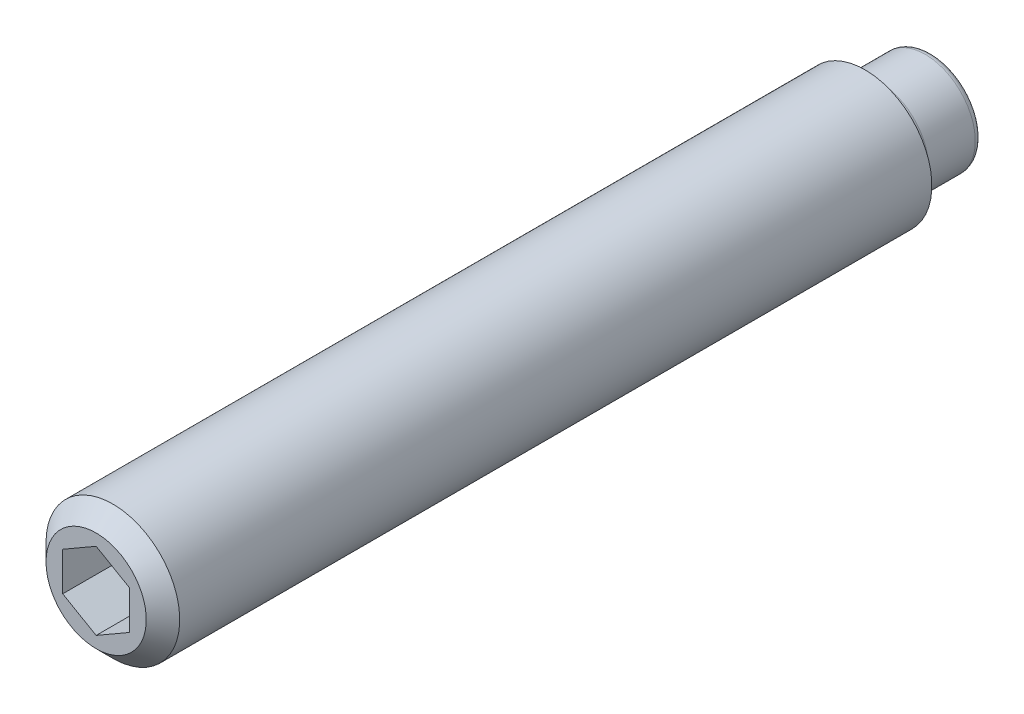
ISO-10303-21;
HEADER;
FILE_DESCRIPTION(('STEP AP214'),'2;1');
FILE_NAME('part.step','',(''),(''),'','','');
FILE_SCHEMA(('AUTOMOTIVE_DESIGN { 1 0 10303 214 1 1 1 1 }'));
ENDSEC;
DATA;
#1=APPLICATION_CONTEXT('core data for automotive mechanical design processes');
#2=APPLICATION_PROTOCOL_DEFINITION('international standard','automotive_design',2000,#1);
#3=PRODUCT_CONTEXT('',#1,'mechanical');
#4=PRODUCT('Part','Part','',(#3));
#5=PRODUCT_RELATED_PRODUCT_CATEGORY('part','',(#4));
#6=PRODUCT_DEFINITION_FORMATION('','',#4);
#7=PRODUCT_DEFINITION_CONTEXT('part definition',#1,'design');
#8=PRODUCT_DEFINITION('design','',#6,#7);
#9=PRODUCT_DEFINITION_SHAPE('','',#8);
#10=(LENGTH_UNIT() NAMED_UNIT(*) SI_UNIT(.MILLI.,.METRE.));
#11=(NAMED_UNIT(*) PLANE_ANGLE_UNIT() SI_UNIT($,.RADIAN.));
#12=(NAMED_UNIT(*) SI_UNIT($,.STERADIAN.) SOLID_ANGLE_UNIT());
#13=UNCERTAINTY_MEASURE_WITH_UNIT(LENGTH_MEASURE(1.E-05),#10,'distance_accuracy_value','');
#14=(GEOMETRIC_REPRESENTATION_CONTEXT(3) GLOBAL_UNCERTAINTY_ASSIGNED_CONTEXT((#13)) GLOBAL_UNIT_ASSIGNED_CONTEXT((#10,
#11,#12)) REPRESENTATION_CONTEXT('',''));
#15=CARTESIAN_POINT('',(0.,0.,0.));
#16=DIRECTION('',(0.,0.,1.));
#17=DIRECTION('',(1.,0.,0.));
#18=AXIS2_PLACEMENT_3D('',#15,#16,#17);
#19=CARTESIAN_POINT('',(0.,0.,100.000000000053));
#20=DIRECTION('',(0.,0.,-1.));
#21=DIRECTION('',(-1.,0.,0.));
#22=AXIS2_PLACEMENT_3D('',#19,#20,#21);
#23=PLANE('',#22);
#24=DIRECTION('',(-0.866025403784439,-0.5,0.));
#25=VECTOR('',#24,1.);
#26=CARTESIAN_POINT('',(0.,4.61880215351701,100.000000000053));
#27=LINE('',#26,#25);
#28=CARTESIAN_POINT('',(0.,4.61880215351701,100.000000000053));
#29=VERTEX_POINT('',#28);
#30=CARTESIAN_POINT('',(-4.,2.30940107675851,100.000000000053));
#31=VERTEX_POINT('',#30);
#32=EDGE_CURVE('E102',#29,#31,#27,.T.);
#33=ORIENTED_EDGE('',*,*,#32,.F.);
#34=DIRECTION('',(-0.866025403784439,0.5,0.));
#35=VECTOR('',#34,1.);
#36=CARTESIAN_POINT('',(4.,2.30940107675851,100.000000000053));
#37=LINE('',#36,#35);
#38=CARTESIAN_POINT('',(4.,2.30940107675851,100.000000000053));
#39=VERTEX_POINT('',#38);
#40=EDGE_CURVE('E28',#39,#29,#37,.T.);
#41=ORIENTED_EDGE('',*,*,#40,.F.);
#42=DIRECTION('',(0.,1.,0.));
#43=VECTOR('',#42,1.);
#44=CARTESIAN_POINT('',(4.,-2.30940107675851,100.000000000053));
#45=LINE('',#44,#43);
#46=CARTESIAN_POINT('',(4.,-2.30940107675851,100.000000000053));
#47=VERTEX_POINT('',#46);
#48=EDGE_CURVE('E111',#47,#39,#45,.T.);
#49=ORIENTED_EDGE('',*,*,#48,.F.);
#50=DIRECTION('',(0.866025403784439,0.5,0.));
#51=VECTOR('',#50,1.);
#52=CARTESIAN_POINT('',(0.,-4.61880215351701,100.000000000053));
#53=LINE('',#52,#51);
#54=CARTESIAN_POINT('',(0.,-4.61880215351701,100.000000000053));
#55=VERTEX_POINT('',#54);
#56=EDGE_CURVE('E109',#55,#47,#53,.T.);
#57=ORIENTED_EDGE('',*,*,#56,.F.);
#58=DIRECTION('',(0.866025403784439,-0.5,0.));
#59=VECTOR('',#58,1.);
#60=CARTESIAN_POINT('',(-4.,-2.30940107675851,100.000000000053));
#61=LINE('',#60,#59);
#62=CARTESIAN_POINT('',(-4.,-2.30940107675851,100.000000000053));
#63=VERTEX_POINT('',#62);
#64=EDGE_CURVE('E76',#63,#55,#61,.T.);
#65=ORIENTED_EDGE('',*,*,#64,.F.);
#66=DIRECTION('',(0.,-1.,0.));
#67=VECTOR('',#66,1.);
#68=CARTESIAN_POINT('',(-4.,2.30940107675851,100.000000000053));
#69=LINE('',#68,#67);
#70=EDGE_CURVE('E105',#31,#63,#69,.T.);
#71=ORIENTED_EDGE('',*,*,#70,.F.);
#72=EDGE_LOOP('',(#33,#41,#49,#57,#65,#71));
#73=FACE_BOUND('',#72,.T.);
#74=CARTESIAN_POINT('',(0.,0.,100.000000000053));
#75=DIRECTION('',(0.,0.,-1.));
#76=DIRECTION('',(-1.,0.,0.));
#77=AXIS2_PLACEMENT_3D('',#74,#75,#76);
#78=CIRCLE('',#77,5.99999999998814);
#79=CARTESIAN_POINT('',(-5.99999999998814,0.,100.000000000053));
#80=VERTEX_POINT('',#79);
#81=EDGE_CURVE('E9',#80,#80,#78,.T.);
#82=ORIENTED_EDGE('',*,*,#81,.F.);
#83=EDGE_LOOP('',(#82));
#84=FACE_BOUND('',#83,.T.);
#85=ADVANCED_FACE('F14',(#73,#84),#23,.F.);
#86=CARTESIAN_POINT('',(0.,0.,100.000000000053));
#87=DIRECTION('',(0.,0.,-1.));
#88=DIRECTION('',(-1.,0.,0.));
#89=AXIS2_PLACEMENT_3D('',#86,#87,#88);
#90=CONICAL_SURFACE('',#89,5.99999999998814,0.785398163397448);
#91=CARTESIAN_POINT('',(0.,0.,98.));
#92=DIRECTION('',(0.,0.,-1.));
#93=DIRECTION('',(-1.,0.,0.));
#94=AXIS2_PLACEMENT_3D('',#91,#92,#93);
#95=CIRCLE('',#94,8.00000000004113);
#96=CARTESIAN_POINT('',(-8.00000000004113,0.,98.));
#97=VERTEX_POINT('',#96);
#98=EDGE_CURVE('E21',#97,#97,#95,.T.);
#99=ORIENTED_EDGE('',*,*,#98,.F.);
#100=EDGE_LOOP('',(#99));
#101=FACE_BOUND('',#100,.T.);
#102=ORIENTED_EDGE('',*,*,#81,.T.);
#103=EDGE_LOOP('',(#102));
#104=FACE_BOUND('',#103,.T.);
#105=ADVANCED_FACE('F139',(#101,#104),#90,.T.);
#106=CARTESIAN_POINT('',(0.,0.,0.));
#107=DIRECTION('',(0.,0.,-1.));
#108=DIRECTION('',(-1.,0.,0.));
#109=AXIS2_PLACEMENT_3D('',#106,#107,#108);
#110=CYLINDRICAL_SURFACE('',#109,8.00000000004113);
#111=CARTESIAN_POINT('',(0.,0.,7.99999999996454));
#112=DIRECTION('',(0.,0.,-1.));
#113=DIRECTION('',(-1.,0.,0.));
#114=AXIS2_PLACEMENT_3D('',#111,#112,#113);
#115=CIRCLE('',#114,8.00000000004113);
#116=CARTESIAN_POINT('',(-8.00000000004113,0.,7.99999999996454));
#117=VERTEX_POINT('',#116);
#118=EDGE_CURVE('E132',#117,#117,#115,.T.);
#119=ORIENTED_EDGE('',*,*,#118,.F.);
#120=EDGE_LOOP('',(#119));
#121=FACE_BOUND('',#120,.T.);
#122=ORIENTED_EDGE('',*,*,#98,.T.);
#123=EDGE_LOOP('',(#122));
#124=FACE_BOUND('',#123,.T.);
#125=ADVANCED_FACE('F137',(#121,#124),#110,.T.);
#126=CARTESIAN_POINT('',(0.,0.,7.99999999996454));
#127=DIRECTION('',(0.,0.,1.));
#128=DIRECTION('',(1.,0.,0.));
#129=AXIS2_PLACEMENT_3D('',#126,#127,#128);
#130=CONICAL_SURFACE('',#129,8.00000000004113,1.0471975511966);
#131=CARTESIAN_POINT('',(0.,0.,7.07623956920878));
#132=DIRECTION('',(0.,0.,-1.));
#133=DIRECTION('',(-1.,0.,0.));
#134=AXIS2_PLACEMENT_3D('',#131,#132,#133);
#135=CIRCLE('',#134,6.39999999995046);
#136=CARTESIAN_POINT('',(-6.39999999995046,0.,7.07623956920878));
#137=VERTEX_POINT('',#136);
#138=EDGE_CURVE('E129',#137,#137,#135,.T.);
#139=ORIENTED_EDGE('',*,*,#138,.F.);
#140=EDGE_LOOP('',(#139));
#141=FACE_BOUND('',#140,.T.);
#142=ORIENTED_EDGE('',*,*,#118,.T.);
#143=EDGE_LOOP('',(#142));
#144=FACE_BOUND('',#143,.T.);
#145=ADVANCED_FACE('F183',(#141,#144),#130,.T.);
#146=CARTESIAN_POINT('',(0.,0.,6.38341924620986));
#147=DIRECTION('',(0.,0.,-1.));
#148=DIRECTION('',(-1.,0.,0.));
#149=AXIS2_PLACEMENT_3D('',#146,#147,#148);
#150=TOROIDAL_SURFACE('',#149,6.8,0.8);
#151=CARTESIAN_POINT('',(0.,0.,6.38341924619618));
#152=DIRECTION('',(0.,0.,-1.));
#153=DIRECTION('',(-1.,0.,0.));
#154=AXIS2_PLACEMENT_3D('',#151,#152,#153);
#155=CIRCLE('',#154,6.);
#156=CARTESIAN_POINT('',(-6.,0.,6.38341924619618));
#157=VERTEX_POINT('',#156);
#158=EDGE_CURVE('E126',#157,#157,#155,.T.);
#159=ORIENTED_EDGE('',*,*,#158,.F.);
#160=EDGE_LOOP('',(#159));
#161=FACE_BOUND('',#160,.T.);
#162=ORIENTED_EDGE('',*,*,#138,.T.);
#163=EDGE_LOOP('',(#162));
#164=FACE_BOUND('',#163,.T.);
#165=ADVANCED_FACE('F179',(#161,#164),#150,.F.);
#166=CARTESIAN_POINT('',(0.,0.,0.));
#167=DIRECTION('',(0.,0.,-1.));
#168=DIRECTION('',(-1.,0.,0.));
#169=AXIS2_PLACEMENT_3D('',#166,#167,#168);
#170=CYLINDRICAL_SURFACE('',#169,6.);
#171=CARTESIAN_POINT('',(0.,0.,0.800000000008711));
#172=DIRECTION('',(0.,0.,-1.));
#173=DIRECTION('',(-1.,0.,0.));
#174=AXIS2_PLACEMENT_3D('',#171,#172,#173);
#175=CIRCLE('',#174,6.);
#176=CARTESIAN_POINT('',(-6.,0.,0.800000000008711));
#177=VERTEX_POINT('',#176);
#178=EDGE_CURVE('E123',#177,#177,#175,.T.);
#179=ORIENTED_EDGE('',*,*,#178,.F.);
#180=EDGE_LOOP('',(#179));
#181=FACE_BOUND('',#180,.T.);
#182=ORIENTED_EDGE('',*,*,#158,.T.);
#183=EDGE_LOOP('',(#182));
#184=FACE_BOUND('',#183,.T.);
#185=ADVANCED_FACE('F175',(#181,#184),#170,.T.);
#186=CARTESIAN_POINT('',(0.,0.,0.8));
#187=DIRECTION('',(0.,0.,-1.));
#188=DIRECTION('',(-1.,0.,0.));
#189=AXIS2_PLACEMENT_3D('',#186,#187,#188);
#190=TOROIDAL_SURFACE('',#189,5.2,0.8);
#191=CARTESIAN_POINT('',(0.,0.,0.));
#192=DIRECTION('',(0.,0.,-1.));
#193=DIRECTION('',(-1.,0.,0.));
#194=AXIS2_PLACEMENT_3D('',#191,#192,#193);
#195=CIRCLE('',#194,5.19999999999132);
#196=CARTESIAN_POINT('',(-5.19999999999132,0.,0.));
#197=VERTEX_POINT('',#196);
#198=EDGE_CURVE('E115',#197,#197,#195,.T.);
#199=ORIENTED_EDGE('',*,*,#198,.F.);
#200=EDGE_LOOP('',(#199));
#201=FACE_BOUND('',#200,.T.);
#202=ORIENTED_EDGE('',*,*,#178,.T.);
#203=EDGE_LOOP('',(#202));
#204=FACE_BOUND('',#203,.T.);
#205=ADVANCED_FACE('F167',(#201,#204),#190,.T.);
#206=CARTESIAN_POINT('',(0.,0.,0.));
#207=DIRECTION('',(0.,0.,1.));
#208=DIRECTION('',(1.,0.,0.));
#209=AXIS2_PLACEMENT_3D('',#206,#207,#208);
#210=PLANE('',#209);
#211=ORIENTED_EDGE('',*,*,#198,.T.);
#212=EDGE_LOOP('',(#211));
#213=FACE_BOUND('',#212,.T.);
#214=ADVANCED_FACE('F159',(#213),#210,.F.);
#215=CARTESIAN_POINT('',(4.,2.30940107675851,94.0000000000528));
#216=DIRECTION('',(0.5,0.866025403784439,0.));
#217=DIRECTION('',(-0.866025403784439,0.5,0.));
#218=AXIS2_PLACEMENT_3D('',#215,#216,#217);
#219=PLANE('',#218);
#220=ORIENTED_EDGE('',*,*,#40,.T.);
#221=DIRECTION('',(0.,0.,1.));
#222=VECTOR('',#221,1.);
#223=CARTESIAN_POINT('',(0.,4.61880215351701,94.0000000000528));
#224=LINE('',#223,#222);
#225=CARTESIAN_POINT('',(0.,4.61880215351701,94.0000000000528));
#226=VERTEX_POINT('',#225);
#227=EDGE_CURVE('E58',#226,#29,#224,.T.);
#228=ORIENTED_EDGE('',*,*,#227,.F.);
#229=DIRECTION('',(-0.866025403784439,0.5,0.));
#230=VECTOR('',#229,1.);
#231=CARTESIAN_POINT('',(4.,2.30940107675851,94.0000000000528));
#232=LINE('',#231,#230);
#233=CARTESIAN_POINT('',(4.,2.30940107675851,94.0000000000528));
#234=VERTEX_POINT('',#233);
#235=EDGE_CURVE('E113',#234,#226,#232,.T.);
#236=ORIENTED_EDGE('',*,*,#235,.F.);
#237=DIRECTION('',(0.,0.,1.));
#238=VECTOR('',#237,1.);
#239=CARTESIAN_POINT('',(4.,2.30940107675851,94.0000000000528));
#240=LINE('',#239,#238);
#241=EDGE_CURVE('E36',#234,#39,#240,.T.);
#242=ORIENTED_EDGE('',*,*,#241,.T.);
#243=EDGE_LOOP('',(#220,#228,#236,#242));
#244=FACE_BOUND('',#243,.T.);
#245=ADVANCED_FACE('F156',(#244),#219,.F.);
#246=CARTESIAN_POINT('',(4.,-2.30940107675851,94.0000000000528));
#247=DIRECTION('',(1.,0.,0.));
#248=DIRECTION('',(0.,0.,-1.));
#249=AXIS2_PLACEMENT_3D('',#246,#247,#248);
#250=PLANE('',#249);
#251=ORIENTED_EDGE('',*,*,#48,.T.);
#252=ORIENTED_EDGE('',*,*,#241,.F.);
#253=DIRECTION('',(0.,1.,0.));
#254=VECTOR('',#253,1.);
#255=CARTESIAN_POINT('',(4.,-2.30940107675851,94.0000000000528));
#256=LINE('',#255,#254);
#257=CARTESIAN_POINT('',(4.,-2.30940107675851,94.0000000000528));
#258=VERTEX_POINT('',#257);
#259=EDGE_CURVE('E88',#258,#234,#256,.T.);
#260=ORIENTED_EDGE('',*,*,#259,.F.);
#261=DIRECTION('',(0.,0.,1.));
#262=VECTOR('',#261,1.);
#263=CARTESIAN_POINT('',(4.,-2.30940107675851,94.0000000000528));
#264=LINE('',#263,#262);
#265=EDGE_CURVE('E80',#258,#47,#264,.T.);
#266=ORIENTED_EDGE('',*,*,#265,.T.);
#267=EDGE_LOOP('',(#251,#252,#260,#266));
#268=FACE_BOUND('',#267,.T.);
#269=ADVANCED_FACE('F158',(#268),#250,.F.);
#270=CARTESIAN_POINT('',(0.,-4.61880215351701,94.0000000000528));
#271=DIRECTION('',(0.5,-0.866025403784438,0.));
#272=DIRECTION('',(0.866025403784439,0.5,0.));
#273=AXIS2_PLACEMENT_3D('',#270,#271,#272);
#274=PLANE('',#273);
#275=ORIENTED_EDGE('',*,*,#56,.T.);
#276=ORIENTED_EDGE('',*,*,#265,.F.);
#277=DIRECTION('',(0.866025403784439,0.5,0.));
#278=VECTOR('',#277,1.);
#279=CARTESIAN_POINT('',(0.,-4.61880215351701,94.0000000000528));
#280=LINE('',#279,#278);
#281=CARTESIAN_POINT('',(0.,-4.61880215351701,94.0000000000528));
#282=VERTEX_POINT('',#281);
#283=EDGE_CURVE('E84',#282,#258,#280,.T.);
#284=ORIENTED_EDGE('',*,*,#283,.F.);
#285=DIRECTION('',(0.,0.,1.));
#286=VECTOR('',#285,1.);
#287=CARTESIAN_POINT('',(0.,-4.61880215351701,94.0000000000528));
#288=LINE('',#287,#286);
#289=EDGE_CURVE('E69',#282,#55,#288,.T.);
#290=ORIENTED_EDGE('',*,*,#289,.T.);
#291=EDGE_LOOP('',(#275,#276,#284,#290));
#292=FACE_BOUND('',#291,.T.);
#293=ADVANCED_FACE('F85',(#292),#274,.F.);
#294=CARTESIAN_POINT('',(-4.,-2.30940107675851,94.0000000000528));
#295=DIRECTION('',(-0.5,-0.866025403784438,0.));
#296=DIRECTION('',(0.866025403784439,-0.5,0.));
#297=AXIS2_PLACEMENT_3D('',#294,#295,#296);
#298=PLANE('',#297);
#299=ORIENTED_EDGE('',*,*,#64,.T.);
#300=ORIENTED_EDGE('',*,*,#289,.F.);
#301=DIRECTION('',(0.866025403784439,-0.5,0.));
#302=VECTOR('',#301,1.);
#303=CARTESIAN_POINT('',(-4.,-2.30940107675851,94.0000000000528));
#304=LINE('',#303,#302);
#305=CARTESIAN_POINT('',(-4.,-2.30940107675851,94.0000000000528));
#306=VERTEX_POINT('',#305);
#307=EDGE_CURVE('E73',#306,#282,#304,.T.);
#308=ORIENTED_EDGE('',*,*,#307,.F.);
#309=DIRECTION('',(0.,0.,1.));
#310=VECTOR('',#309,1.);
#311=CARTESIAN_POINT('',(-4.,-2.30940107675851,94.0000000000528));
#312=LINE('',#311,#310);
#313=EDGE_CURVE('E81',#306,#63,#312,.T.);
#314=ORIENTED_EDGE('',*,*,#313,.T.);
#315=EDGE_LOOP('',(#299,#300,#308,#314));
#316=FACE_BOUND('',#315,.T.);
#317=ADVANCED_FACE('F71',(#316),#298,.F.);
#318=CARTESIAN_POINT('',(-4.,2.30940107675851,94.0000000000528));
#319=DIRECTION('',(-1.,0.,0.));
#320=DIRECTION('',(0.,0.,1.));
#321=AXIS2_PLACEMENT_3D('',#318,#319,#320);
#322=PLANE('',#321);
#323=ORIENTED_EDGE('',*,*,#70,.T.);
#324=ORIENTED_EDGE('',*,*,#313,.F.);
#325=DIRECTION('',(0.,-1.,0.));
#326=VECTOR('',#325,1.);
#327=CARTESIAN_POINT('',(-4.,2.30940107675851,94.0000000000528));
#328=LINE('',#327,#326);
#329=CARTESIAN_POINT('',(-4.,2.30940107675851,94.0000000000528));
#330=VERTEX_POINT('',#329);
#331=EDGE_CURVE('E94',#330,#306,#328,.T.);
#332=ORIENTED_EDGE('',*,*,#331,.F.);
#333=DIRECTION('',(0.,0.,1.));
#334=VECTOR('',#333,1.);
#335=CARTESIAN_POINT('',(-4.,2.30940107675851,94.0000000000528));
#336=LINE('',#335,#334);
#337=EDGE_CURVE('E118',#330,#31,#336,.T.);
#338=ORIENTED_EDGE('',*,*,#337,.T.);
#339=EDGE_LOOP('',(#323,#324,#332,#338));
#340=FACE_BOUND('',#339,.T.);
#341=ADVANCED_FACE('F265',(#340),#322,.F.);
#342=CARTESIAN_POINT('',(0.,4.61880215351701,94.0000000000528));
#343=DIRECTION('',(-0.5,0.866025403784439,0.));
#344=DIRECTION('',(-0.866025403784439,-0.5,0.));
#345=AXIS2_PLACEMENT_3D('',#342,#343,#344);
#346=PLANE('',#345);
#347=ORIENTED_EDGE('',*,*,#32,.T.);
#348=ORIENTED_EDGE('',*,*,#337,.F.);
#349=DIRECTION('',(-0.866025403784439,-0.5,0.));
#350=VECTOR('',#349,1.);
#351=CARTESIAN_POINT('',(0.,4.61880215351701,94.0000000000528));
#352=LINE('',#351,#350);
#353=EDGE_CURVE('E96',#226,#330,#352,.T.);
#354=ORIENTED_EDGE('',*,*,#353,.F.);
#355=ORIENTED_EDGE('',*,*,#227,.T.);
#356=EDGE_LOOP('',(#347,#348,#354,#355));
#357=FACE_BOUND('',#356,.T.);
#358=ADVANCED_FACE('F154',(#357),#346,.F.);
#359=CARTESIAN_POINT('',(0.,0.,94.0000000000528));
#360=DIRECTION('',(0.,0.,1.));
#361=DIRECTION('',(1.,0.,0.));
#362=AXIS2_PLACEMENT_3D('',#359,#360,#361);
#363=PLANE('',#362);
#364=ORIENTED_EDGE('',*,*,#235,.T.);
#365=ORIENTED_EDGE('',*,*,#353,.T.);
#366=ORIENTED_EDGE('',*,*,#331,.T.);
#367=ORIENTED_EDGE('',*,*,#307,.T.);
#368=ORIENTED_EDGE('',*,*,#283,.T.);
#369=ORIENTED_EDGE('',*,*,#259,.T.);
#370=EDGE_LOOP('',(#364,#365,#366,#367,#368,#369));
#371=FACE_BOUND('',#370,.T.);
#372=ADVANCED_FACE('F91',(#371),#363,.T.);
#373=CLOSED_SHELL('',(#85,#105,#125,#145,#165,#185,#205,#214,#245,#269,#293,#317,#341,#358,#372));
#374=MANIFOLD_SOLID_BREP('B1',#373);
#375=ADVANCED_BREP_SHAPE_REPRESENTATION('',(#18,#374),#14);
#376=SHAPE_DEFINITION_REPRESENTATION(#9,#375);
ENDSEC;
END-ISO-10303-21;
